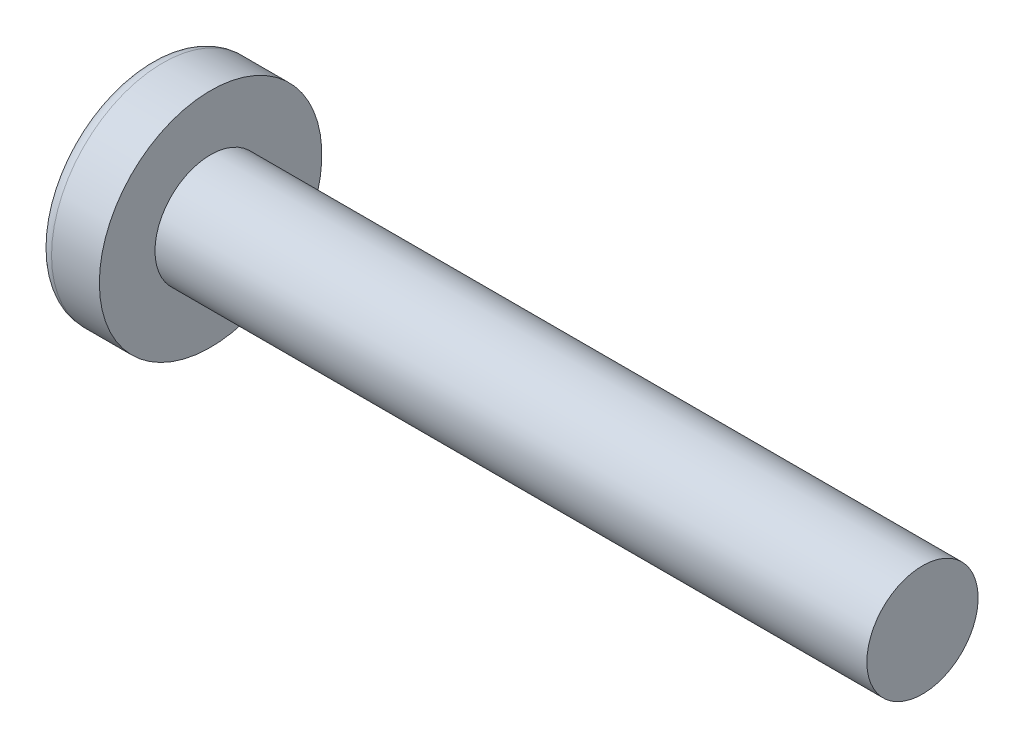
from build123d import *

# Parameters (mm, degrees)
CIRPATTERN1_COUNT = 2
CIRPATTERN1_ANGLE = 90


with BuildPart() as part:
    # BodySke → Base-Revolve (revolve)
    with BuildSketch(Plane.XY, mode=Mode.PRIVATE) as base_revolve_sk:
        with BuildLine():
            Line((2.1, 1.25), (2.1, 2.5))
            Line((2.1, 2.5), (1.025105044, 2.5))
            ThreePointArc((1.025105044, 2.5), (0.890037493, 2.467874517), (0.783897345, 2.378378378))
            ThreePointArc((0.783897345, 2.378378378), (0.201025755, 1.252116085), (0, 0))
            Line((0, 0), (18.1, 0))
            Line((18.1, 0), (18.1, 1.25))
            Line((18.1, 1.25), (2.1, 1.25))
        make_face()
    revolve(base_revolve_sk.sketch.rotate(Axis((-25.4, 0, 0), (1, 0, 0)), 90), axis=Axis((-25.4, 0, 0), (1, 0, 0)))

    # Sketch3 → Cut-Loft1 section 0
    with BuildSketch(Plane(origin=(0, 0, 0), x_dir=(0, 0, -1), z_dir=(1, 0, 0))):
        with BuildLine():
            Line((0.35, -1.34), (-0.35, -1.34))
            Line((-0.35, -1.34), (-0.35, 1.34))
            Line((-0.35, 1.34), (0.35, 1.34))
            Line((0.35, 1.34), (0.35, -1.34))
        make_face()
    # Sketch4 → Cut-Loft1 section 1
    with BuildSketch(Plane(origin=(1.53, 0, 0), x_dir=(0, 0, -1), z_dir=(1, 0, 0))):
        with BuildLine():
            Line((0.175, -0.175), (-0.175, -0.175))
            Line((-0.175, -0.175), (-0.175, 0.175))
            Line((-0.175, 0.175), (0.175, 0.175))
            Line((0.175, 0.175), (0.175, -0.175))
        make_face()
    cut_loft1 = loft(mode=Mode.SUBTRACT)

    # CirPattern1: Cut-Loft1 ×2 about axis
    cirpattern1_axis = Axis((0, 0, 0), (1, 0, 0))
    for i in range(1, CIRPATTERN1_COUNT):
        add(cut_loft1.rotate(cirpattern1_axis, i * CIRPATTERN1_ANGLE / (CIRPATTERN1_COUNT - 1)), mode=Mode.SUBTRACT)


solid = part.part
